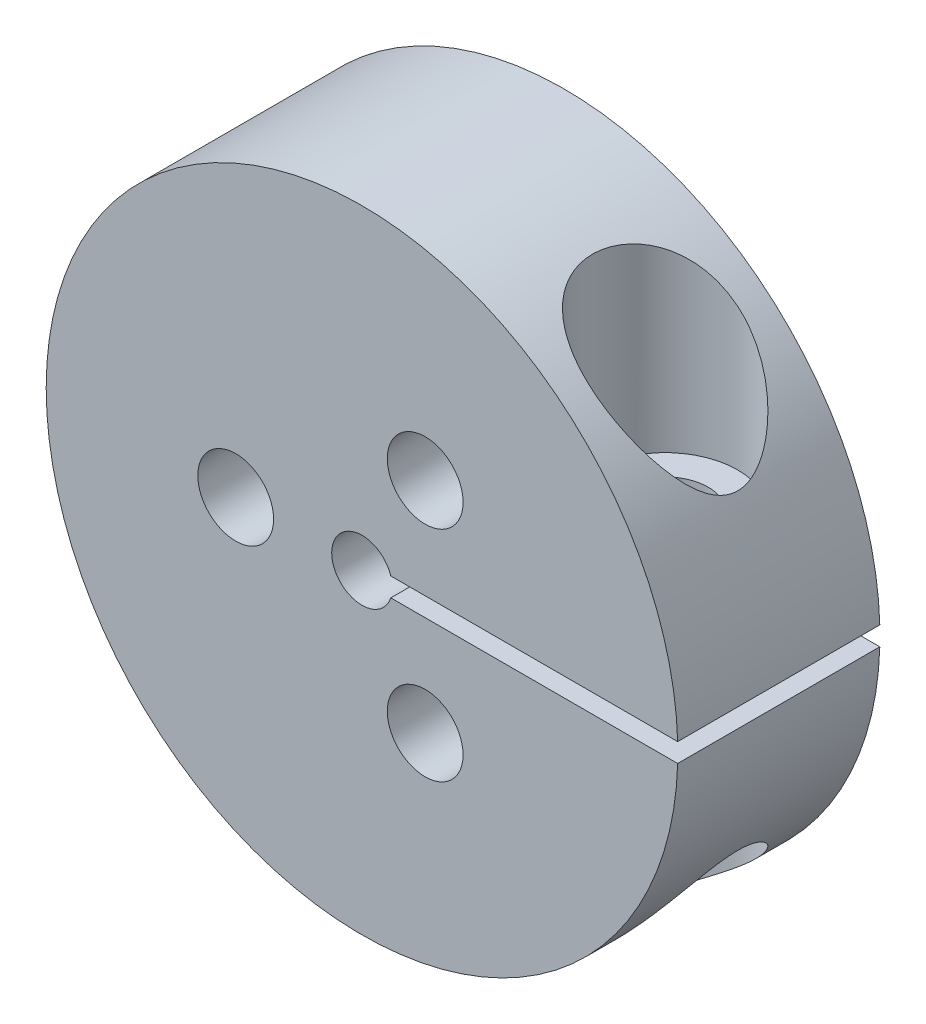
ISO-10303-21;
HEADER;
FILE_DESCRIPTION(('STEP AP214'),'2;1');
FILE_NAME('part.step','',(''),(''),'','','');
FILE_SCHEMA(('AUTOMOTIVE_DESIGN { 1 0 10303 214 1 1 1 1 }'));
ENDSEC;
DATA;
#1=APPLICATION_CONTEXT('core data for automotive mechanical design processes');
#2=APPLICATION_PROTOCOL_DEFINITION('international standard','automotive_design',2000,#1);
#3=PRODUCT_CONTEXT('',#1,'mechanical');
#4=PRODUCT('Part','Part','',(#3));
#5=PRODUCT_RELATED_PRODUCT_CATEGORY('part','',(#4));
#6=PRODUCT_DEFINITION_FORMATION('','',#4);
#7=PRODUCT_DEFINITION_CONTEXT('part definition',#1,'design');
#8=PRODUCT_DEFINITION('design','',#6,#7);
#9=PRODUCT_DEFINITION_SHAPE('','',#8);
#10=(LENGTH_UNIT() NAMED_UNIT(*) SI_UNIT(.MILLI.,.METRE.));
#11=(NAMED_UNIT(*) PLANE_ANGLE_UNIT() SI_UNIT($,.RADIAN.));
#12=(NAMED_UNIT(*) SI_UNIT($,.STERADIAN.) SOLID_ANGLE_UNIT());
#13=UNCERTAINTY_MEASURE_WITH_UNIT(LENGTH_MEASURE(1.E-05),#10,'distance_accuracy_value','');
#14=(GEOMETRIC_REPRESENTATION_CONTEXT(3) GLOBAL_UNCERTAINTY_ASSIGNED_CONTEXT((#13)) GLOBAL_UNIT_ASSIGNED_CONTEXT((#10,
#11,#12)) REPRESENTATION_CONTEXT('',''));
#15=CARTESIAN_POINT('',(0.,0.,0.));
#16=DIRECTION('',(0.,0.,1.));
#17=DIRECTION('',(1.,0.,0.));
#18=AXIS2_PLACEMENT_3D('',#15,#16,#17);
#19=CARTESIAN_POINT('',(8.,-12.5,0.));
#20=DIRECTION('',(0.,1.,0.));
#21=DIRECTION('',(0.,0.,1.));
#22=AXIS2_PLACEMENT_3D('',#19,#20,#21);
#23=CYLINDRICAL_SURFACE('',#22,1.55);
#24=CARTESIAN_POINT('',(8.,-0.375,0.));
#25=DIRECTION('',(0.,1.,0.));
#26=DIRECTION('',(0.,0.,1.));
#27=AXIS2_PLACEMENT_3D('',#24,#25,#26);
#28=CIRCLE('',#27,1.55);
#29=CARTESIAN_POINT('',(8.,-0.375,1.55));
#30=VERTEX_POINT('',#29);
#31=EDGE_CURVE('E123',#30,#30,#28,.T.);
#32=ORIENTED_EDGE('',*,*,#31,.T.);
#33=EDGE_LOOP('',(#32));
#34=FACE_BOUND('',#33,.T.);
#35=CARTESIAN_POINT('',(8.,-4.,0.));
#36=DIRECTION('',(0.,-1.,0.));
#37=DIRECTION('',(0.,0.,-1.));
#38=AXIS2_PLACEMENT_3D('',#35,#36,#37);
#39=CIRCLE('',#38,1.55);
#40=CARTESIAN_POINT('',(8.,-4.,-1.55));
#41=VERTEX_POINT('',#40);
#42=EDGE_CURVE('E136',#41,#41,#39,.F.);
#43=ORIENTED_EDGE('',*,*,#42,.F.);
#44=EDGE_LOOP('',(#43));
#45=FACE_BOUND('',#44,.T.);
#46=ADVANCED_FACE('F45',(#34,#45),#23,.F.);
#47=CARTESIAN_POINT('',(0.,0.,4.));
#48=DIRECTION('',(0.,0.,-1.));
#49=DIRECTION('',(-1.,0.,0.));
#50=AXIS2_PLACEMENT_3D('',#47,#48,#49);
#51=CYLINDRICAL_SURFACE('',#50,12.5);
#52=CARTESIAN_POINT('',(8.,-9.60468635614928,2.875));
#53=CARTESIAN_POINT('',(8.1864175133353,-9.44940514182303,2.87500158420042));
#54=CARTESIAN_POINT('',(8.36841423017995,-9.28855816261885,2.85688274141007));
#55=CARTESIAN_POINT('',(8.71995989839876,-8.95938613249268,2.78917273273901));
#56=CARTESIAN_POINT('',(8.88947054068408,-8.79104041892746,2.73948887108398));
#57=CARTESIAN_POINT('',(9.1458220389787,-8.52189588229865,2.63874470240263));
#58=CARTESIAN_POINT('',(9.23763027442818,-8.42224055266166,2.59691962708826));
#59=CARTESIAN_POINT('',(9.4159300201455,-8.22241890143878,2.50417023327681));
#60=CARTESIAN_POINT('',(9.50242238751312,-8.12225266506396,2.45324738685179));
#61=CARTESIAN_POINT('',(9.66980878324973,-7.92223398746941,2.34252673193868));
#62=CARTESIAN_POINT('',(9.75070535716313,-7.82238142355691,2.28273299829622));
#63=CARTESIAN_POINT('',(9.90662820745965,-7.62395267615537,2.15420414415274));
#64=CARTESIAN_POINT('',(9.98165666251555,-7.52537603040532,2.08547236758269));
#65=CARTESIAN_POINT('',(10.1477809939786,-7.30051622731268,1.91593672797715));
#66=CARTESIAN_POINT('',(10.2366880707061,-7.17507282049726,1.81178168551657));
#67=CARTESIAN_POINT('',(10.3609080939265,-6.99335454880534,1.64213994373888));
#68=CARTESIAN_POINT('',(10.4007828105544,-6.93386985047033,1.58337364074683));
#69=CARTESIAN_POINT('',(10.4771858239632,-6.81787279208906,1.46095255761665));
#70=CARTESIAN_POINT('',(10.5137153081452,-6.76135938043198,1.39729952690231));
#71=CARTESIAN_POINT('',(10.5947460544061,-6.63391305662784,1.24216540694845));
#72=CARTESIAN_POINT('',(10.6377601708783,-6.56457452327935,1.14855799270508));
#73=CARTESIAN_POINT('',(10.71533460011,-6.43716935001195,0.950698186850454));
#74=CARTESIAN_POINT('',(10.749909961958,-6.37908268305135,0.846465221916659));
#75=CARTESIAN_POINT('',(10.800076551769,-6.29365615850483,0.657238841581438));
#76=CARTESIAN_POINT('',(10.8182736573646,-6.26225275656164,0.574804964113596));
#77=CARTESIAN_POINT('',(10.8476055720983,-6.21130636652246,0.405150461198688));
#78=CARTESIAN_POINT('',(10.8587509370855,-6.19174565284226,0.317937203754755));
#79=CARTESIAN_POINT('',(10.8729807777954,-6.16672662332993,0.140049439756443));
#80=CARTESIAN_POINT('',(10.8759987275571,-6.16138469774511,0.0493524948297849));
#81=CARTESIAN_POINT('',(10.8734138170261,-6.16594485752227,-0.131543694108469));
#82=CARTESIAN_POINT('',(10.8678089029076,-6.17585057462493,-0.221742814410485));
#83=CARTESIAN_POINT('',(10.8496683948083,-6.20765417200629,-0.38902536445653));
#84=CARTESIAN_POINT('',(10.8379410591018,-6.22815113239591,-0.466477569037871));
#85=CARTESIAN_POINT('',(10.8090065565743,-6.27823359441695,-0.617257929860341));
#86=CARTESIAN_POINT('',(10.791797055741,-6.30782296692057,-0.690584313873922));
#87=CARTESIAN_POINT('',(10.7387762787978,-6.39788924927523,-0.883604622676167));
#88=CARTESIAN_POINT('',(10.6984787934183,-6.46529326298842,-0.998808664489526));
#89=CARTESIAN_POINT('',(10.607745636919,-6.61311645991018,-1.2162495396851));
#90=CARTESIAN_POINT('',(10.5572722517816,-6.69358383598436,-1.31843575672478));
#91=CARTESIAN_POINT('',(10.4551803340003,-6.85178394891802,-1.49901392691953));
#92=CARTESIAN_POINT('',(10.4045083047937,-6.92858261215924,-1.57878152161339));
#93=CARTESIAN_POINT('',(10.2977961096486,-7.08621642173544,-1.73042279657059));
#94=CARTESIAN_POINT('',(10.2417519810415,-7.16705452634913,-1.80229056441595));
#95=CARTESIAN_POINT('',(10.1247800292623,-7.33137207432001,-1.93881865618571));
#96=CARTESIAN_POINT('',(10.0638477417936,-7.41485388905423,-2.00347225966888));
#97=CARTESIAN_POINT('',(9.93748503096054,-7.58336891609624,-2.12591462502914));
#98=CARTESIAN_POINT('',(9.87205571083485,-7.6684017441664,-2.1837050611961));
#99=CARTESIAN_POINT('',(9.73179893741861,-7.84575148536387,-2.29678314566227));
#100=CARTESIAN_POINT('',(9.65663492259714,-7.93813324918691,-2.35155162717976));
#101=CARTESIAN_POINT('',(9.50155593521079,-8.12311586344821,-2.45348016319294));
#102=CARTESIAN_POINT('',(9.42164046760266,-8.2157167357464,-2.50063942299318));
#103=CARTESIAN_POINT('',(9.25730675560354,-8.40044800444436,-2.58716381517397));
#104=CARTESIAN_POINT('',(9.17289190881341,-8.4925786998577,-2.62653472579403));
#105=CARTESIAN_POINT('',(8.99973507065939,-8.67586994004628,-2.69720381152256));
#106=CARTESIAN_POINT('',(8.91099162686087,-8.76703014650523,-2.72849925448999));
#107=CARTESIAN_POINT('',(8.63997235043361,-9.03688093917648,-2.80916156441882));
#108=CARTESIAN_POINT('',(8.45152453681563,-9.21350577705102,-2.84604224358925));
#109=CARTESIAN_POINT('',(8.15955923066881,-9.47040276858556,-2.87223016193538));
#110=CARTESIAN_POINT('',(8.06068051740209,-9.55470126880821,-2.87610312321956));
#111=CARTESIAN_POINT('',(7.86043656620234,-9.7201017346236,-2.87335576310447));
#112=CARTESIAN_POINT('',(7.75907198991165,-9.80120453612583,-2.86673820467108));
#113=CARTESIAN_POINT('',(7.49618480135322,-10.0049185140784,-2.83513099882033));
#114=CARTESIAN_POINT('',(7.3333933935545,-10.1247583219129,-2.80180218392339));
#115=CARTESIAN_POINT('',(7.00867507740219,-10.3521816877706,-2.70399141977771));
#116=CARTESIAN_POINT('',(6.84674734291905,-10.4597803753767,-2.63954845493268));
#117=CARTESIAN_POINT('',(6.55437617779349,-10.644974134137,-2.48968775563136));
#118=CARTESIAN_POINT('',(6.42287650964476,-10.7246455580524,-2.4089199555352));
#119=CARTESIAN_POINT('',(6.17042556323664,-10.8718528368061,-2.22324036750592));
#120=CARTESIAN_POINT('',(6.04947183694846,-10.939391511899,-2.11833420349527));
#121=CARTESIAN_POINT('',(5.82318955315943,-11.0615155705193,-1.88511138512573));
#122=CARTESIAN_POINT('',(5.71794420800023,-11.1160328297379,-1.7566775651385));
#123=CARTESIAN_POINT('',(5.52948234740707,-11.2109776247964,-1.47991720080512));
#124=CARTESIAN_POINT('',(5.44625820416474,-11.2514100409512,-1.3315975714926));
#125=CARTESIAN_POINT('',(5.31333083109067,-11.3147436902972,-1.03501579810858));
#126=CARTESIAN_POINT('',(5.26116492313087,-11.3389617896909,-0.888134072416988));
#127=CARTESIAN_POINT('',(5.18114400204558,-11.3757511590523,-0.586508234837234));
#128=CARTESIAN_POINT('',(5.15328052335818,-11.3883264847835,-0.431766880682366));
#129=CARTESIAN_POINT('',(5.12394974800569,-11.4015515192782,-0.127220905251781));
#130=CARTESIAN_POINT('',(5.12122270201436,-11.4027704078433,0.0224393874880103));
#131=CARTESIAN_POINT('',(5.13898807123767,-11.3947749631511,0.320080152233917));
#132=CARTESIAN_POINT('',(5.15947726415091,-11.3855620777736,0.468060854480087));
#133=CARTESIAN_POINT('',(5.22245105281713,-11.3568116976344,0.756591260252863));
#134=CARTESIAN_POINT('',(5.2647068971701,-11.3373815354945,0.897201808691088));
#135=CARTESIAN_POINT('',(5.36928079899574,-11.28823018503,1.16881173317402));
#136=CARTESIAN_POINT('',(5.43159907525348,-11.2585088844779,1.29981100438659));
#137=CARTESIAN_POINT('',(5.57501629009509,-11.1881928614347,1.55126193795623));
#138=CARTESIAN_POINT('',(5.65644133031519,-11.1474071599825,1.67147364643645));
#139=CARTESIAN_POINT('',(5.83402036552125,-11.0555045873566,1.89595740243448));
#140=CARTESIAN_POINT('',(5.9301760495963,-11.0043865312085,2.00022761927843));
#141=CARTESIAN_POINT('',(6.13926691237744,-10.8891875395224,2.1965906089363));
#142=CARTESIAN_POINT('',(6.25284270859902,-10.8245379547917,2.28766440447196));
#143=CARTESIAN_POINT('',(6.4880331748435,-10.6852291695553,2.44948769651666));
#144=CARTESIAN_POINT('',(6.60965234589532,-10.6105643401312,2.52022569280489));
#145=CARTESIAN_POINT('',(6.8709951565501,-10.4434711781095,2.64848846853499));
#146=CARTESIAN_POINT('',(7.01121227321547,-10.3499890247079,2.70361885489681));
#147=CARTESIAN_POINT('',(7.29232542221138,-10.1538840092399,2.79042479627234));
#148=CARTESIAN_POINT('',(7.43322121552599,-10.0512641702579,2.82210807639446));
#149=CARTESIAN_POINT('',(7.64490512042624,-9.89008013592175,2.85391957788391));
#150=CARTESIAN_POINT('',(7.71667088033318,-9.8341895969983,2.86189774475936));
#151=CARTESIAN_POINT('',(7.8591657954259,-9.72068989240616,2.87243617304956));
#152=CARTESIAN_POINT('',(7.92989549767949,-9.6630816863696,2.87499940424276));
#153=CARTESIAN_POINT('',(8.,-9.60468635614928,2.875));
#154=B_SPLINE_CURVE_WITH_KNOTS('',3,(#52,#53,#54,#55,#56,#57,#58,#59,#60,#61,#62,#63,#64,#65,
#66,#67,#68,#69,#70,#71,#72,#73,#74,#75,#76,#77,#78,#79,#80,#81,#82,#83,#84,#85,#86,#87,#88,#89,
#90,#91,#92,#93,#94,#95,#96,#97,#98,#99,#100,#101,#102,#103,#104,#105,#106,#107,#108,#109,#110,
#111,#112,#113,#114,#115,#116,#117,#118,#119,#120,#121,#122,#123,#124,#125,#126,#127,#128,#129,
#130,#131,#132,#133,#134,#135,#136,#137,#138,#139,#140,#141,#142,#143,#144,#145,#146,#147,#148,
#149,#150,#151,#152,#153),.UNSPECIFIED.,.T.,.F.,(4,2,2,2,2,2,2,2,2,2,2,2,2,2,2,2,2,2,2,2,2,2,2,
2,2,2,2,2,2,2,2,2,2,2,2,2,2,2,2,2,2,2,2,2,2,2,2,2,2,2,4),(0.,0.727603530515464,1.45735372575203,
1.88242711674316,2.3074317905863,2.73224183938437,3.15689341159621,3.7126198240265,
3.99034893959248,4.26797908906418,4.63958641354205,5.0105261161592,5.27977175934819,
5.54861340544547,5.81964902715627,6.09074921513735,6.33275817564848,6.57487030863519,
6.99073784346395,7.40817598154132,7.77298984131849,8.13807490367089,8.50349727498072,
8.86883031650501,9.26177157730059,9.65475384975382,10.0474434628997,10.440265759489,
11.2193223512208,11.6089109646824,11.9983969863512,12.6105064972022,13.2218510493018,
13.7406803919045,14.2593889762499,14.7807546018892,15.3019393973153,15.772742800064,
16.24338213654,16.6902980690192,17.137151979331,17.5794027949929,18.0216584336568,
18.4720954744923,18.9225842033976,19.3984897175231,19.8746638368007,20.4046137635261,
20.9343890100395,21.2081630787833,21.4817869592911),.UNSPECIFIED.);
#155=CARTESIAN_POINT('',(8.,-9.60468635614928,2.875));
#156=VERTEX_POINT('',#155);
#157=EDGE_CURVE('E49',#156,#156,#154,.T.);
#158=ORIENTED_EDGE('',*,*,#157,.T.);
#159=EDGE_LOOP('',(#158));
#160=FACE_BOUND('',#159,.T.);
#161=CARTESIAN_POINT('',(0.,0.,-4.));
#162=DIRECTION('',(0.,0.,1.));
#163=DIRECTION('',(1.,0.,0.));
#164=AXIS2_PLACEMENT_3D('',#161,#162,#163);
#165=CIRCLE('',#164,12.5);
#166=CARTESIAN_POINT('',(12.4943737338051,0.375,-4.));
#167=VERTEX_POINT('',#166);
#168=CARTESIAN_POINT('',(12.4943737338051,-0.375,-4.));
#169=VERTEX_POINT('',#168);
#170=EDGE_CURVE('E170',#167,#169,#165,.T.);
#171=ORIENTED_EDGE('',*,*,#170,.T.);
#172=DIRECTION('',(0.,0.,-1.));
#173=VECTOR('',#172,1.);
#174=CARTESIAN_POINT('',(12.4943737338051,-0.375,4.));
#175=LINE('',#174,#173);
#176=CARTESIAN_POINT('',(12.4943737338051,-0.375,4.));
#177=VERTEX_POINT('',#176);
#178=EDGE_CURVE('E84',#177,#169,#175,.T.);
#179=ORIENTED_EDGE('',*,*,#178,.F.);
#180=CARTESIAN_POINT('',(0.,0.,4.));
#181=DIRECTION('',(0.,0.,1.));
#182=DIRECTION('',(1.,0.,0.));
#183=AXIS2_PLACEMENT_3D('',#180,#181,#182);
#184=CIRCLE('',#183,12.5);
#185=CARTESIAN_POINT('',(12.4943737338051,0.375,4.));
#186=VERTEX_POINT('',#185);
#187=EDGE_CURVE('E96',#186,#177,#184,.T.);
#188=ORIENTED_EDGE('',*,*,#187,.F.);
#189=DIRECTION('',(0.,0.,-1.));
#190=VECTOR('',#189,1.);
#191=CARTESIAN_POINT('',(12.4943737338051,0.375,4.));
#192=LINE('',#191,#190);
#193=EDGE_CURVE('E61',#186,#167,#192,.T.);
#194=ORIENTED_EDGE('',*,*,#193,.T.);
#195=EDGE_LOOP('',(#171,#179,#188,#194));
#196=FACE_BOUND('',#195,.T.);
#197=CARTESIAN_POINT('',(8.,9.60468635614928,-2.875));
#198=CARTESIAN_POINT('',(7.90586483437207,9.68309790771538,-2.87499953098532));
#199=CARTESIAN_POINT('',(7.81059049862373,9.76010322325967,-2.87037905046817));
#200=CARTESIAN_POINT('',(7.61845841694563,9.91080040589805,-2.8512041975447));
#201=CARTESIAN_POINT('',(7.521601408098,9.98449375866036,-2.83665432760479));
#202=CARTESIAN_POINT('',(7.32728053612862,10.1279577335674,-2.7969437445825));
#203=CARTESIAN_POINT('',(7.22981736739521,10.1977321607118,-2.77179353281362));
#204=CARTESIAN_POINT('',(7.03540096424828,10.3328193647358,-2.71027109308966));
#205=CARTESIAN_POINT('',(6.938447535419,10.398133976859,-2.67390351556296));
#206=CARTESIAN_POINT('',(6.70379257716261,10.5516108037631,-2.57067597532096));
#207=CARTESIAN_POINT('',(6.56705452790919,10.6370859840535,-2.49744452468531));
#208=CARTESIAN_POINT('',(6.30254544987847,10.795911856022,-2.32573863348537));
#209=CARTESIAN_POINT('',(6.17476953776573,10.8692691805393,-2.22727807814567));
#210=CARTESIAN_POINT('',(5.99397135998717,10.9693732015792,-2.06113258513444));
#211=CARTESIAN_POINT('',(5.93532977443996,11.0011798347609,-2.00243612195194));
#212=CARTESIAN_POINT('',(5.82257396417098,11.0612701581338,-1.87920261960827));
#213=CARTESIAN_POINT('',(5.76845769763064,11.0895554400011,-1.81466824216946));
#214=CARTESIAN_POINT('',(5.66548848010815,11.1425131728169,-1.68013539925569));
#215=CARTESIAN_POINT('',(5.61663569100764,11.1671855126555,-1.61013676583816));
#216=CARTESIAN_POINT('',(5.52490747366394,11.2128505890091,-1.46523267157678));
#217=CARTESIAN_POINT('',(5.48203139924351,11.2338437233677,-1.39032774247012));
#218=CARTESIAN_POINT('',(5.37141602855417,11.2873447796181,-1.17485739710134));
#219=CARTESIAN_POINT('',(5.31097535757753,11.3157558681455,-1.02939191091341));
#220=CARTESIAN_POINT('',(5.21447036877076,11.3605531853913,-0.728946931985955));
#221=CARTESIAN_POINT('',(5.17839658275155,11.3769440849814,-0.573971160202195));
#222=CARTESIAN_POINT('',(5.13368318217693,11.3971862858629,-0.268733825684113));
#223=CARTESIAN_POINT('',(5.12354608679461,11.4017223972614,-0.118736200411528));
#224=CARTESIAN_POINT('',(5.12679033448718,11.4002644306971,0.180935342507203));
#225=CARTESIAN_POINT('',(5.14016774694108,11.3942721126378,0.330609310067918));
#226=CARTESIAN_POINT('',(5.18946261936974,11.3719031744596,0.62302230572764));
#227=CARTESIAN_POINT('',(5.22503384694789,11.3556860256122,0.765832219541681));
#228=CARTESIAN_POINT('',(5.31688143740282,11.312971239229,1.04298265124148));
#229=CARTESIAN_POINT('',(5.37315746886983,11.2864737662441,1.17732330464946));
#230=CARTESIAN_POINT('',(5.50495694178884,11.2227827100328,1.4358724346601));
#231=CARTESIAN_POINT('',(5.58073547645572,11.1854464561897,1.55991534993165));
#232=CARTESIAN_POINT('',(5.74797476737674,11.1004307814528,1.79292702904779));
#233=CARTESIAN_POINT('',(5.83943761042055,11.0527499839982,1.90189378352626));
#234=CARTESIAN_POINT('',(6.03929186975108,10.9448819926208,2.10780410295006));
#235=CARTESIAN_POINT('',(6.1482966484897,10.8841930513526,2.20388695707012));
#236=CARTESIAN_POINT('',(6.37541434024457,10.7527351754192,2.37627840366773));
#237=CARTESIAN_POINT('',(6.49353000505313,10.6819631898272,2.4525809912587));
#238=CARTESIAN_POINT('',(6.74736336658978,10.5236716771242,2.5922214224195));
#239=CARTESIAN_POINT('',(6.8836428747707,10.4351785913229,2.65342249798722));
#240=CARTESIAN_POINT('',(7.15816268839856,10.248817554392,2.75286778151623));
#241=CARTESIAN_POINT('',(7.29640421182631,10.1509435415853,2.79109702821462));
#242=CARTESIAN_POINT('',(7.5326426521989,9.97619354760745,2.83854932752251));
#243=CARTESIAN_POINT('',(7.63102188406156,9.90115509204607,2.85290665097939));
#244=CARTESIAN_POINT('',(7.82610065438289,9.74769634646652,2.87140851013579));
#245=CARTESIAN_POINT('',(7.92279961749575,9.66927492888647,2.87554961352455));
#246=CARTESIAN_POINT('',(8.20951178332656,9.4295163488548,2.87372470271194));
#247=CARTESIAN_POINT('',(8.39596490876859,9.26381440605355,2.85347828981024));
#248=CARTESIAN_POINT('',(8.68718261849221,8.98925288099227,2.79400170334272));
#249=CARTESIAN_POINT('',(8.79625287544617,8.88250380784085,2.76480048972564));
#250=CARTESIAN_POINT('',(9.00856507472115,8.66709612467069,2.69460718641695));
#251=CARTESIAN_POINT('',(9.11180829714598,8.55843794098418,2.65361769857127));
#252=CARTESIAN_POINT('',(9.3121661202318,8.33999887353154,2.56048318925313));
#253=CARTESIAN_POINT('',(9.40927228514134,8.2302166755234,2.50832322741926));
#254=CARTESIAN_POINT('',(9.59687080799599,8.01067384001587,2.39326872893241));
#255=CARTESIAN_POINT('',(9.68736516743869,7.90091320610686,2.33037746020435));
#256=CARTESIAN_POINT('',(9.84251135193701,7.70629138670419,2.20868080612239));
#257=CARTESIAN_POINT('',(9.90850859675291,7.62119743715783,2.15195220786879));
#258=CARTESIAN_POINT('',(10.036029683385,7.45246810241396,2.03172055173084));
#259=CARTESIAN_POINT('',(10.097554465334,7.36883241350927,1.96821892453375));
#260=CARTESIAN_POINT('',(10.215679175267,7.20417479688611,1.83421655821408));
#261=CARTESIAN_POINT('',(10.272291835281,7.12314647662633,1.76373499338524));
#262=CARTESIAN_POINT('',(10.3802748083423,6.96484454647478,1.61504047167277));
#263=CARTESIAN_POINT('',(10.4316488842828,6.88756826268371,1.53683314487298));
#264=CARTESIAN_POINT('',(10.5287608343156,6.73818766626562,1.3712307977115));
#265=CARTESIAN_POINT('',(10.574461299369,6.66611886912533,1.28378117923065));
#266=CARTESIAN_POINT('',(10.658593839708,6.53075081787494,1.09899743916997));
#267=CARTESIAN_POINT('',(10.697030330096,6.46744624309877,1.00166937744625));
#268=CARTESIAN_POINT('',(10.7582852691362,6.36491817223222,0.815593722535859));
#269=CARTESIAN_POINT('',(10.7826805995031,6.32340508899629,0.728653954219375));
#270=CARTESIAN_POINT('',(10.8237701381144,6.25281399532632,0.548142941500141));
#271=CARTESIAN_POINT('',(10.8404797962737,6.22371104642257,0.454585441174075));
#272=CARTESIAN_POINT('',(10.8624867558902,6.18520742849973,0.279553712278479));
#273=CARTESIAN_POINT('',(10.8692721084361,6.17324565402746,0.198839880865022));
#274=CARTESIAN_POINT('',(10.8759198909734,6.16152734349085,0.0362535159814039));
#275=CARTESIAN_POINT('',(10.87578634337,6.16176371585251,-0.0456183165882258));
#276=CARTESIAN_POINT('',(10.8686200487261,6.17439414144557,-0.20794665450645));
#277=CARTESIAN_POINT('',(10.8615981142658,6.18676914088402,-0.288405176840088));
#278=CARTESIAN_POINT('',(10.8412977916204,6.22227229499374,-0.446086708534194));
#279=CARTESIAN_POINT('',(10.8280129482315,6.24541154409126,-0.523306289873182));
#280=CARTESIAN_POINT('',(10.7885545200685,6.31341878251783,-0.708757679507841));
#281=CARTESIAN_POINT('',(10.7592571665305,6.36338770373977,-0.814431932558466));
#282=CARTESIAN_POINT('',(10.6917498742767,6.47617213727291,-1.01560157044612));
#283=CARTESIAN_POINT('',(10.6535145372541,6.53902419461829,-1.11106679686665));
#284=CARTESIAN_POINT('',(10.5760636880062,6.66344262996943,-1.27937743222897));
#285=CARTESIAN_POINT('',(10.5377804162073,6.7238933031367,-1.35350123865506));
#286=CARTESIAN_POINT('',(10.4568092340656,6.84913898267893,-1.49545896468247));
#287=CARTESIAN_POINT('',(10.4141181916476,6.91393706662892,-1.56328834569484));
#288=CARTESIAN_POINT('',(10.3247679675,7.04667183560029,-1.69331386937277));
#289=CARTESIAN_POINT('',(10.2781007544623,7.11461474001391,-1.75549806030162));
#290=CARTESIAN_POINT('',(10.1811987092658,7.2526071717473,-1.87453613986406));
#291=CARTESIAN_POINT('',(10.1309628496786,7.32265730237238,-1.93138848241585));
#292=CARTESIAN_POINT('',(10.000073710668,7.50108867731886,-2.06843438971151));
#293=CARTESIAN_POINT('',(9.91722367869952,7.61040280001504,-2.14533270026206));
#294=CARTESIAN_POINT('',(9.74432220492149,7.83056910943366,-2.28812889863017));
#295=CARTESIAN_POINT('',(9.65426702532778,7.94142206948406,-2.35402102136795));
#296=CARTESIAN_POINT('',(9.46745939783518,8.16322256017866,-2.47478050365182));
#297=CARTESIAN_POINT('',(9.37071547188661,8.2741697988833,-2.52966155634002));
#298=CARTESIAN_POINT('',(9.17082481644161,8.49518569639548,-2.62815512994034));
#299=CARTESIAN_POINT('',(9.06768081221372,8.60525470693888,-2.67177240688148));
#300=CARTESIAN_POINT('',(8.8121307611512,8.86804312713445,-2.76246314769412));
#301=CARTESIAN_POINT('',(8.65673838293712,9.01991872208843,-2.80373881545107));
#302=CARTESIAN_POINT('',(8.33546349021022,9.31761315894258,-2.86000865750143));
#303=CARTESIAN_POINT('',(8.16958018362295,9.46343154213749,-2.87500084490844));
#304=CARTESIAN_POINT('',(8.,9.60468635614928,-2.875));
#305=B_SPLINE_CURVE_WITH_KNOTS('',3,(#197,#198,#199,#200,#201,#202,#203,#204,#205,#206,#207,
#208,#209,#210,#211,#212,#213,#214,#215,#216,#217,#218,#219,#220,#221,#222,#223,#224,#225,#226,
#227,#228,#229,#230,#231,#232,#233,#234,#235,#236,#237,#238,#239,#240,#241,#242,#243,#244,#245,
#246,#247,#248,#249,#250,#251,#252,#253,#254,#255,#256,#257,#258,#259,#260,#261,#262,#263,#264,
#265,#266,#267,#268,#269,#270,#271,#272,#273,#274,#275,#276,#277,#278,#279,#280,#281,#282,#283,
#284,#285,#286,#287,#288,#289,#290,#291,#292,#293,#294,#295,#296,#297,#298,#299,#300,#301,#302,
#303,#304),.UNSPECIFIED.,.T.,.F.,(4,2,2,2,2,2,2,2,2,2,2,2,2,2,2,2,2,2,2,2,2,2,2,2,2,2,2,2,2,2,2,
2,2,2,2,2,2,2,2,2,2,2,2,2,2,2,2,2,2,2,2,2,2,4),(0.,0.367384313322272,0.734602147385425,
1.10145704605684,1.46816006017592,1.99721398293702,2.52597735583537,2.79223469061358,
3.05837123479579,3.3245159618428,3.59063189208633,4.06810174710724,4.54538596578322,
4.99441900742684,5.44337699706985,5.8855003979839,6.32761672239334,6.77583915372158,
7.22412126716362,7.69456517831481,8.16515173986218,8.68407581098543,9.2033374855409,
9.57653799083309,9.94986386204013,10.6971685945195,11.1628599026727,11.628448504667,
12.0946637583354,12.5607372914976,12.9256339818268,13.2904537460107,13.6542977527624,
14.0178785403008,14.3837418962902,14.7493821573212,15.0465307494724,15.3430793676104,
15.587592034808,15.8319625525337,16.0759500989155,16.3201896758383,16.6796638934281,
17.0401722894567,17.3488201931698,17.6576889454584,17.9671970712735,18.276794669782,
18.7478991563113,19.2192496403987,19.6900102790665,20.1605718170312,20.8223477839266,
21.4841737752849),.UNSPECIFIED.);
#306=CARTESIAN_POINT('',(8.,9.60468635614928,-2.875));
#307=VERTEX_POINT('',#306);
#308=EDGE_CURVE('E128',#307,#307,#305,.T.);
#309=ORIENTED_EDGE('',*,*,#308,.F.);
#310=EDGE_LOOP('',(#309));
#311=FACE_BOUND('',#310,.T.);
#312=ADVANCED_FACE('F98',(#160,#196,#311),#51,.T.);
#313=CARTESIAN_POINT('',(0.,0.,4.));
#314=DIRECTION('',(0.,0.,-1.));
#315=DIRECTION('',(-1.,0.,0.));
#316=AXIS2_PLACEMENT_3D('',#313,#314,#315);
#317=CYLINDRICAL_SURFACE('',#316,1.2);
#318=CARTESIAN_POINT('',(0.,0.,-4.));
#319=DIRECTION('',(0.,0.,1.));
#320=DIRECTION('',(1.,0.,0.));
#321=AXIS2_PLACEMENT_3D('',#318,#319,#320);
#322=CIRCLE('',#321,1.2);
#323=CARTESIAN_POINT('',(1.1399013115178,0.375,-4.));
#324=VERTEX_POINT('',#323);
#325=CARTESIAN_POINT('',(1.1399013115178,-0.375,-4.));
#326=VERTEX_POINT('',#325);
#327=EDGE_CURVE('E194',#324,#326,#322,.T.);
#328=ORIENTED_EDGE('',*,*,#327,.F.);
#329=DIRECTION('',(0.,0.,-1.));
#330=VECTOR('',#329,1.);
#331=CARTESIAN_POINT('',(1.1399013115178,0.375,4.));
#332=LINE('',#331,#330);
#333=CARTESIAN_POINT('',(1.1399013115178,0.375,4.));
#334=VERTEX_POINT('',#333);
#335=EDGE_CURVE('E11',#334,#324,#332,.T.);
#336=ORIENTED_EDGE('',*,*,#335,.F.);
#337=CARTESIAN_POINT('',(0.,0.,4.));
#338=DIRECTION('',(0.,0.,1.));
#339=DIRECTION('',(1.,0.,0.));
#340=AXIS2_PLACEMENT_3D('',#337,#338,#339);
#341=CIRCLE('',#340,1.2);
#342=CARTESIAN_POINT('',(1.1399013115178,-0.375,4.));
#343=VERTEX_POINT('',#342);
#344=EDGE_CURVE('E110',#334,#343,#341,.T.);
#345=ORIENTED_EDGE('',*,*,#344,.T.);
#346=DIRECTION('',(0.,0.,-1.));
#347=VECTOR('',#346,1.);
#348=CARTESIAN_POINT('',(1.1399013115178,-0.375,4.));
#349=LINE('',#348,#347);
#350=EDGE_CURVE('E70',#343,#326,#349,.T.);
#351=ORIENTED_EDGE('',*,*,#350,.T.);
#352=EDGE_LOOP('',(#328,#336,#345,#351));
#353=FACE_BOUND('',#352,.T.);
#354=ADVANCED_FACE('F227',(#353),#317,.F.);
#355=CARTESIAN_POINT('',(0.,0.375,4.));
#356=DIRECTION('',(0.,1.,0.));
#357=DIRECTION('',(0.,0.,1.));
#358=AXIS2_PLACEMENT_3D('',#355,#356,#357);
#359=PLANE('',#358);
#360=CARTESIAN_POINT('',(8.,0.375,0.));
#361=DIRECTION('',(0.,1.,0.));
#362=DIRECTION('',(0.,0.,1.));
#363=AXIS2_PLACEMENT_3D('',#360,#361,#362);
#364=CIRCLE('',#363,1.7);
#365=CARTESIAN_POINT('',(8.,0.375,1.7));
#366=VERTEX_POINT('',#365);
#367=EDGE_CURVE('E208',#366,#366,#364,.F.);
#368=ORIENTED_EDGE('',*,*,#367,.F.);
#369=EDGE_LOOP('',(#368));
#370=FACE_BOUND('',#369,.T.);
#371=DIRECTION('',(1.,0.,0.));
#372=VECTOR('',#371,1.);
#373=CARTESIAN_POINT('',(0.,0.375,-4.));
#374=LINE('',#373,#372);
#375=EDGE_CURVE('E116',#324,#167,#374,.T.);
#376=ORIENTED_EDGE('',*,*,#375,.T.);
#377=ORIENTED_EDGE('',*,*,#193,.F.);
#378=DIRECTION('',(1.,0.,0.));
#379=VECTOR('',#378,1.);
#380=CARTESIAN_POINT('',(0.,0.375,4.));
#381=LINE('',#380,#379);
#382=EDGE_CURVE('E106',#334,#186,#381,.T.);
#383=ORIENTED_EDGE('',*,*,#382,.F.);
#384=ORIENTED_EDGE('',*,*,#335,.T.);
#385=EDGE_LOOP('',(#376,#377,#383,#384));
#386=FACE_BOUND('',#385,.T.);
#387=ADVANCED_FACE('F114',(#370,#386),#359,.F.);
#388=CARTESIAN_POINT('',(2.50000000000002,4.33012701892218,4.));
#389=DIRECTION('',(0.,0.,-1.));
#390=DIRECTION('',(-1.,0.,0.));
#391=AXIS2_PLACEMENT_3D('',#388,#389,#390);
#392=CYLINDRICAL_SURFACE('',#391,1.5);
#393=CARTESIAN_POINT('',(2.50000000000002,4.33012701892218,4.));
#394=DIRECTION('',(0.,0.,1.));
#395=DIRECTION('',(1.,0.,0.));
#396=AXIS2_PLACEMENT_3D('',#393,#394,#395);
#397=CIRCLE('',#396,1.5);
#398=CARTESIAN_POINT('',(4.00000000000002,4.33012701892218,4.));
#399=VERTEX_POINT('',#398);
#400=EDGE_CURVE('E222',#399,#399,#397,.T.);
#401=ORIENTED_EDGE('',*,*,#400,.T.);
#402=EDGE_LOOP('',(#401));
#403=FACE_BOUND('',#402,.T.);
#404=CARTESIAN_POINT('',(2.50000000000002,4.33012701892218,-4.));
#405=DIRECTION('',(0.,0.,1.));
#406=DIRECTION('',(1.,0.,0.));
#407=AXIS2_PLACEMENT_3D('',#404,#405,#406);
#408=CIRCLE('',#407,1.5);
#409=CARTESIAN_POINT('',(4.00000000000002,4.33012701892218,-4.));
#410=VERTEX_POINT('',#409);
#411=EDGE_CURVE('E190',#410,#410,#408,.T.);
#412=ORIENTED_EDGE('',*,*,#411,.F.);
#413=EDGE_LOOP('',(#412));
#414=FACE_BOUND('',#413,.T.);
#415=ADVANCED_FACE('F234',(#403,#414),#392,.F.);
#416=CARTESIAN_POINT('',(2.50000000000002,-4.33012701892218,4.));
#417=DIRECTION('',(0.,0.,-1.));
#418=DIRECTION('',(-1.,0.,0.));
#419=AXIS2_PLACEMENT_3D('',#416,#417,#418);
#420=CYLINDRICAL_SURFACE('',#419,1.50000000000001);
#421=CARTESIAN_POINT('',(2.50000000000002,-4.33012701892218,4.));
#422=DIRECTION('',(0.,0.,1.));
#423=DIRECTION('',(1.,0.,0.));
#424=AXIS2_PLACEMENT_3D('',#421,#422,#423);
#425=CIRCLE('',#424,1.50000000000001);
#426=CARTESIAN_POINT('',(4.00000000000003,-4.33012701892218,4.));
#427=VERTEX_POINT('',#426);
#428=EDGE_CURVE('E175',#427,#427,#425,.T.);
#429=ORIENTED_EDGE('',*,*,#428,.T.);
#430=EDGE_LOOP('',(#429));
#431=FACE_BOUND('',#430,.T.);
#432=CARTESIAN_POINT('',(2.50000000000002,-4.33012701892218,-4.));
#433=DIRECTION('',(0.,0.,1.));
#434=DIRECTION('',(1.,0.,0.));
#435=AXIS2_PLACEMENT_3D('',#432,#433,#434);
#436=CIRCLE('',#435,1.50000000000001);
#437=CARTESIAN_POINT('',(4.00000000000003,-4.33012701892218,-4.));
#438=VERTEX_POINT('',#437);
#439=EDGE_CURVE('E186',#438,#438,#436,.T.);
#440=ORIENTED_EDGE('',*,*,#439,.F.);
#441=EDGE_LOOP('',(#440));
#442=FACE_BOUND('',#441,.T.);
#443=ADVANCED_FACE('F162',(#431,#442),#420,.F.);
#444=CARTESIAN_POINT('',(-5.,0.,4.));
#445=DIRECTION('',(0.,0.,-1.));
#446=DIRECTION('',(-1.,0.,0.));
#447=AXIS2_PLACEMENT_3D('',#444,#445,#446);
#448=CYLINDRICAL_SURFACE('',#447,1.5);
#449=CARTESIAN_POINT('',(-5.,0.,4.));
#450=DIRECTION('',(0.,0.,1.));
#451=DIRECTION('',(1.,0.,0.));
#452=AXIS2_PLACEMENT_3D('',#449,#450,#451);
#453=CIRCLE('',#452,1.5);
#454=CARTESIAN_POINT('',(-3.5,0.,4.));
#455=VERTEX_POINT('',#454);
#456=EDGE_CURVE('E169',#455,#455,#453,.T.);
#457=ORIENTED_EDGE('',*,*,#456,.T.);
#458=EDGE_LOOP('',(#457));
#459=FACE_BOUND('',#458,.T.);
#460=CARTESIAN_POINT('',(-5.,0.,-4.));
#461=DIRECTION('',(0.,0.,1.));
#462=DIRECTION('',(1.,0.,0.));
#463=AXIS2_PLACEMENT_3D('',#460,#461,#462);
#464=CIRCLE('',#463,1.5);
#465=CARTESIAN_POINT('',(-3.5,0.,-4.));
#466=VERTEX_POINT('',#465);
#467=EDGE_CURVE('E127',#466,#466,#464,.T.);
#468=ORIENTED_EDGE('',*,*,#467,.F.);
#469=EDGE_LOOP('',(#468));
#470=FACE_BOUND('',#469,.T.);
#471=ADVANCED_FACE('F47',(#459,#470),#448,.F.);
#472=CARTESIAN_POINT('',(0.,-0.375,4.));
#473=DIRECTION('',(0.,1.,0.));
#474=DIRECTION('',(0.,0.,1.));
#475=AXIS2_PLACEMENT_3D('',#472,#473,#474);
#476=PLANE('',#475);
#477=ORIENTED_EDGE('',*,*,#31,.F.);
#478=EDGE_LOOP('',(#477));
#479=FACE_BOUND('',#478,.T.);
#480=DIRECTION('',(1.,0.,0.));
#481=VECTOR('',#480,1.);
#482=CARTESIAN_POINT('',(0.,-0.375,-4.));
#483=LINE('',#482,#481);
#484=EDGE_CURVE('E166',#326,#169,#483,.T.);
#485=ORIENTED_EDGE('',*,*,#484,.F.);
#486=ORIENTED_EDGE('',*,*,#350,.F.);
#487=DIRECTION('',(1.,0.,0.));
#488=VECTOR('',#487,1.);
#489=CARTESIAN_POINT('',(0.,-0.375,4.));
#490=LINE('',#489,#488);
#491=EDGE_CURVE('E105',#343,#177,#490,.T.);
#492=ORIENTED_EDGE('',*,*,#491,.T.);
#493=ORIENTED_EDGE('',*,*,#178,.T.);
#494=EDGE_LOOP('',(#485,#486,#492,#493));
#495=FACE_BOUND('',#494,.T.);
#496=ADVANCED_FACE('F153',(#479,#495),#476,.T.);
#497=CARTESIAN_POINT('',(0.,0.,4.));
#498=DIRECTION('',(0.,0.,1.));
#499=DIRECTION('',(1.,0.,0.));
#500=AXIS2_PLACEMENT_3D('',#497,#498,#499);
#501=PLANE('',#500);
#502=ORIENTED_EDGE('',*,*,#456,.F.);
#503=EDGE_LOOP('',(#502));
#504=FACE_BOUND('',#503,.T.);
#505=ORIENTED_EDGE('',*,*,#428,.F.);
#506=EDGE_LOOP('',(#505));
#507=FACE_BOUND('',#506,.T.);
#508=ORIENTED_EDGE('',*,*,#400,.F.);
#509=EDGE_LOOP('',(#508));
#510=FACE_BOUND('',#509,.T.);
#511=ORIENTED_EDGE('',*,*,#344,.F.);
#512=ORIENTED_EDGE('',*,*,#382,.T.);
#513=ORIENTED_EDGE('',*,*,#187,.T.);
#514=ORIENTED_EDGE('',*,*,#491,.F.);
#515=EDGE_LOOP('',(#511,#512,#513,#514));
#516=FACE_BOUND('',#515,.T.);
#517=ADVANCED_FACE('F109',(#504,#507,#510,#516),#501,.T.);
#518=CARTESIAN_POINT('',(0.,0.,-4.));
#519=DIRECTION('',(0.,0.,1.));
#520=DIRECTION('',(1.,0.,0.));
#521=AXIS2_PLACEMENT_3D('',#518,#519,#520);
#522=PLANE('',#521);
#523=ORIENTED_EDGE('',*,*,#467,.T.);
#524=EDGE_LOOP('',(#523));
#525=FACE_BOUND('',#524,.T.);
#526=ORIENTED_EDGE('',*,*,#439,.T.);
#527=EDGE_LOOP('',(#526));
#528=FACE_BOUND('',#527,.T.);
#529=ORIENTED_EDGE('',*,*,#411,.T.);
#530=EDGE_LOOP('',(#529));
#531=FACE_BOUND('',#530,.T.);
#532=ORIENTED_EDGE('',*,*,#327,.T.);
#533=ORIENTED_EDGE('',*,*,#484,.T.);
#534=ORIENTED_EDGE('',*,*,#170,.F.);
#535=ORIENTED_EDGE('',*,*,#375,.F.);
#536=EDGE_LOOP('',(#532,#533,#534,#535));
#537=FACE_BOUND('',#536,.T.);
#538=ADVANCED_FACE('F146',(#525,#528,#531,#537),#522,.F.);
#539=CARTESIAN_POINT('',(8.,12.5,0.));
#540=DIRECTION('',(0.,-1.,0.));
#541=DIRECTION('',(0.,0.,-1.));
#542=AXIS2_PLACEMENT_3D('',#539,#540,#541);
#543=CYLINDRICAL_SURFACE('',#542,2.875);
#544=CARTESIAN_POINT('',(8.,4.,0.));
#545=DIRECTION('',(0.,1.,0.));
#546=DIRECTION('',(0.,0.,1.));
#547=AXIS2_PLACEMENT_3D('',#544,#545,#546);
#548=CIRCLE('',#547,2.875);
#549=CARTESIAN_POINT('',(8.,4.,2.875));
#550=VERTEX_POINT('',#549);
#551=EDGE_CURVE('E135',#550,#550,#548,.T.);
#552=ORIENTED_EDGE('',*,*,#551,.F.);
#553=EDGE_LOOP('',(#552));
#554=FACE_BOUND('',#553,.T.);
#555=ORIENTED_EDGE('',*,*,#308,.T.);
#556=EDGE_LOOP('',(#555));
#557=FACE_BOUND('',#556,.T.);
#558=ADVANCED_FACE('F140',(#554,#557),#543,.F.);
#559=CARTESIAN_POINT('',(8.,4.,0.));
#560=DIRECTION('',(0.,1.,0.));
#561=DIRECTION('',(0.,0.,1.));
#562=AXIS2_PLACEMENT_3D('',#559,#560,#561);
#563=PLANE('',#562);
#564=CARTESIAN_POINT('',(8.,4.,0.));
#565=DIRECTION('',(0.,1.,0.));
#566=DIRECTION('',(0.,0.,1.));
#567=AXIS2_PLACEMENT_3D('',#564,#565,#566);
#568=CIRCLE('',#567,1.7);
#569=CARTESIAN_POINT('',(8.,4.,1.7));
#570=VERTEX_POINT('',#569);
#571=EDGE_CURVE('E212',#570,#570,#568,.T.);
#572=ORIENTED_EDGE('',*,*,#571,.F.);
#573=EDGE_LOOP('',(#572));
#574=FACE_BOUND('',#573,.T.);
#575=ORIENTED_EDGE('',*,*,#551,.T.);
#576=EDGE_LOOP('',(#575));
#577=FACE_BOUND('',#576,.T.);
#578=ADVANCED_FACE('F145',(#574,#577),#563,.T.);
#579=CARTESIAN_POINT('',(8.,-12.5,0.));
#580=DIRECTION('',(0.,1.,0.));
#581=DIRECTION('',(0.,0.,1.));
#582=AXIS2_PLACEMENT_3D('',#579,#580,#581);
#583=CYLINDRICAL_SURFACE('',#582,2.875);
#584=CARTESIAN_POINT('',(8.,-4.,0.));
#585=DIRECTION('',(0.,1.,0.));
#586=DIRECTION('',(0.,0.,1.));
#587=AXIS2_PLACEMENT_3D('',#584,#585,#586);
#588=CIRCLE('',#587,2.875);
#589=CARTESIAN_POINT('',(8.,-4.,2.875));
#590=VERTEX_POINT('',#589);
#591=EDGE_CURVE('E205',#590,#590,#588,.T.);
#592=ORIENTED_EDGE('',*,*,#591,.T.);
#593=EDGE_LOOP('',(#592));
#594=FACE_BOUND('',#593,.T.);
#595=ORIENTED_EDGE('',*,*,#157,.F.);
#596=EDGE_LOOP('',(#595));
#597=FACE_BOUND('',#596,.T.);
#598=ADVANCED_FACE('F308',(#594,#597),#583,.F.);
#599=CARTESIAN_POINT('',(8.,-4.,0.));
#600=DIRECTION('',(0.,-1.,0.));
#601=DIRECTION('',(0.,0.,1.));
#602=AXIS2_PLACEMENT_3D('',#599,#600,#601);
#603=PLANE('',#602);
#604=ORIENTED_EDGE('',*,*,#591,.F.);
#605=EDGE_LOOP('',(#604));
#606=FACE_BOUND('',#605,.T.);
#607=ORIENTED_EDGE('',*,*,#42,.T.);
#608=EDGE_LOOP('',(#607));
#609=FACE_BOUND('',#608,.T.);
#610=ADVANCED_FACE('F313',(#606,#609),#603,.T.);
#611=CARTESIAN_POINT('',(8.,-12.501,0.));
#612=DIRECTION('',(0.,1.,0.));
#613=DIRECTION('',(0.,0.,1.));
#614=AXIS2_PLACEMENT_3D('',#611,#612,#613);
#615=CYLINDRICAL_SURFACE('',#614,1.7);
#616=ORIENTED_EDGE('',*,*,#571,.T.);
#617=EDGE_LOOP('',(#616));
#618=FACE_BOUND('',#617,.T.);
#619=ORIENTED_EDGE('',*,*,#367,.T.);
#620=EDGE_LOOP('',(#619));
#621=FACE_BOUND('',#620,.T.);
#622=ADVANCED_FACE('F322',(#618,#621),#615,.F.);
#623=CLOSED_SHELL('',(#46,#312,#354,#387,#415,#443,#471,#496,#517,#538,#558,#578,#598,#610,#622));
#624=MANIFOLD_SOLID_BREP('B2',#623);
#625=ADVANCED_BREP_SHAPE_REPRESENTATION('',(#18,#624),#14);
#626=SHAPE_DEFINITION_REPRESENTATION(#9,#625);
ENDSEC;
END-ISO-10303-21;
